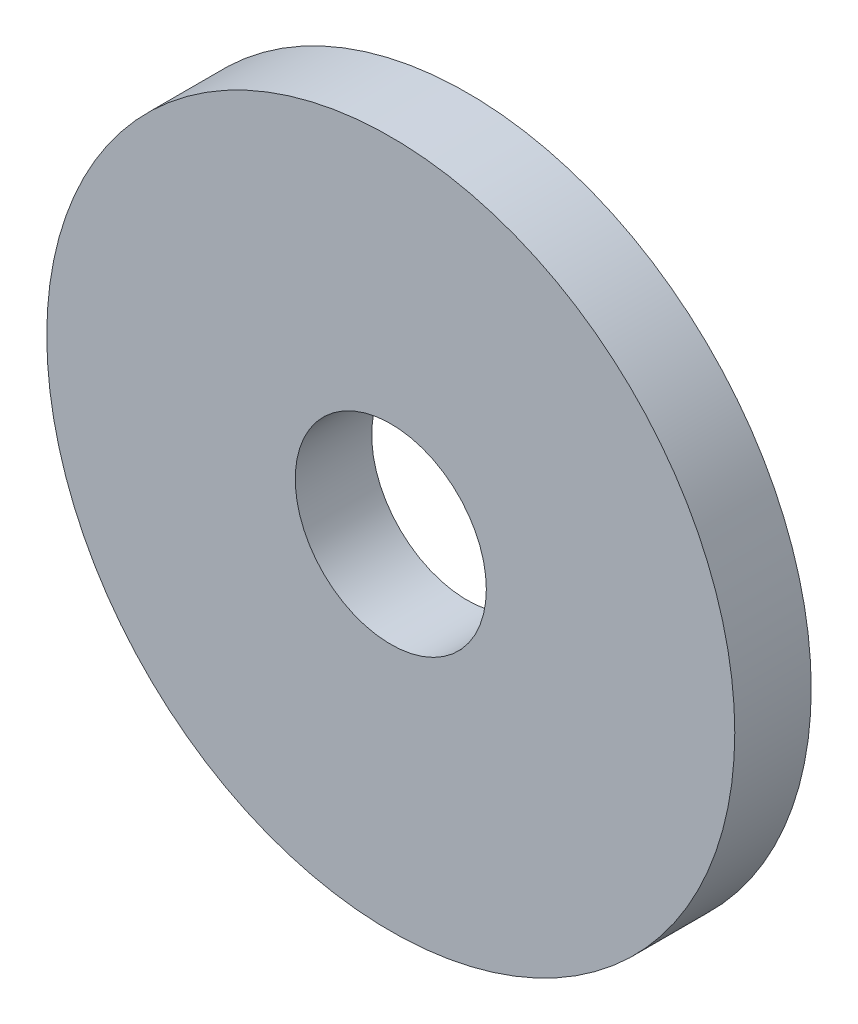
from build123d import *

# Parameters (mm, degrees)
SKETCH1_R          = 9
SKETCH1_R_2        = 2.5
BASE_EXTRUDE_DEPTH = 2


with BuildPart() as part:
    # Sketch1 → Base-Extrude (new body)
    with BuildSketch(Plane.XY):
        Circle(SKETCH1_R)
        Circle(SKETCH1_R_2, mode=Mode.SUBTRACT)
    extrude(amount=-BASE_EXTRUDE_DEPTH)


solid = part.part
